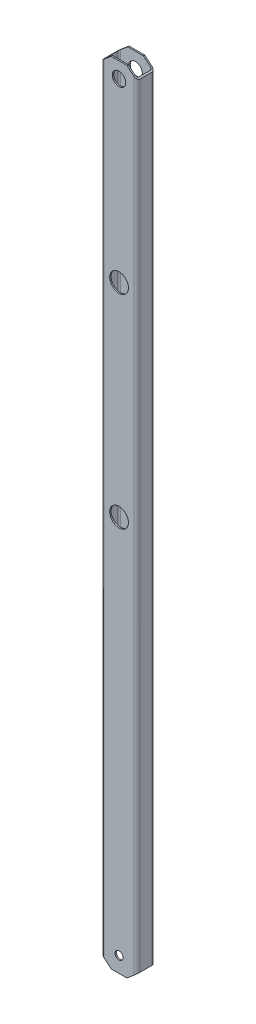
from build123d import *

# Parameters (mm, degrees)
TUBO_RETTANGOLARE_80_X_40_X_3_0_2_DEPTH = 1770
TAGLIO_ESTRUSIONE1_REACH                = 888.806
SCHIZZO8_R                              = 15
SCHIZZO8_R_2                            = 21
SCHIZZO8_R_3                            = 9
TAGLIO_ESTRUSIONE3_REACH                = 888.806
SCHIZZO9_R                              = 21


with BuildPart() as part:
    # Sketch15 → Tubo rettangolare 80 X 40 X 3.0_2 (new body)
    with BuildSketch(Plane(origin=(0, 885, 0), x_dir=(0, 0, -1), z_dir=(0, -1, 0))):
        with BuildLine():
            Line((-13.6, -40), (13.6, -40))
            ThreePointArc((13.6, -40), (18.1254834, -38.1254834), (20, -33.6))
            Line((20, -33.6), (20, 33.6))
            ThreePointArc((20, 33.6), (18.1254834, 38.1254834), (13.6, 40))
            Line((13.6, 40), (-13.6, 40))
            ThreePointArc((-13.6, 40), (-18.1254834, 38.1254834), (-20, 33.6))
            Line((-20, 33.6), (-20, -33.6))
            ThreePointArc((-20, -33.6), (-18.1254834, -38.1254834), (-13.6, -40))
        make_face()
        with BuildLine():
            Line((-13.6, -37), (13.6, -37))
            ThreePointArc((13.6, -37), (16.004163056, -36.004163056), (17, -33.6))
            Line((17, -33.6), (17, 33.6))
            ThreePointArc((17, 33.6), (16.004163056, 36.004163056), (13.6, 37))
            Line((13.6, 37), (-13.6, 37))
            ThreePointArc((-13.6, 37), (-16.004163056, 36.004163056), (-17, 33.6))
            Line((-17, 33.6), (-17, -33.6))
            ThreePointArc((-17, -33.6), (-16.004163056, -36.004163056), (-13.6, -37))
        make_face(mode=Mode.SUBTRACT)
    extrude(amount=TUBO_RETTANGOLARE_80_X_40_X_3_0_2_DEPTH)

    # Taglio-Estrusione1: up to this face of the body (flat: up to its plane)
    taglio_estrusione1_end = Plane(part.part.faces().sort_by_distance((0, 0, -20))[0])
    # Schizzo8 → Taglio-Estrusione1 (cut, up to the picked face)
    with BuildSketch(Plane.XY.offset(20), mode=Mode.PRIVATE) as taglio_estrusione1_sk1:
        with Locations(Location((0, 850, 0), (0, 0, 270))):
            Circle(SCHIZZO8_R)
    taglio_estrusione1_tool1 = split(extrude(taglio_estrusione1_sk1.sketch, amount=-TAGLIO_ESTRUSIONE1_REACH, mode=Mode.PRIVATE), bisect_by=taglio_estrusione1_end, keep=Keep.BOTH, mode=Mode.PRIVATE)
    # Schizzo8 → Taglio-Estrusione1 (cut, up to the picked face)
    with BuildSketch(Plane.XY.offset(20), mode=Mode.PRIVATE) as taglio_estrusione1_sk2:
        with Locations(Location((0, 0, 0), (0, 0, 270))):
            Circle(SCHIZZO8_R_2)
    taglio_estrusione1_tool2 = split(extrude(taglio_estrusione1_sk2.sketch, amount=-TAGLIO_ESTRUSIONE1_REACH, mode=Mode.PRIVATE), bisect_by=taglio_estrusione1_end, keep=Keep.BOTH, mode=Mode.PRIVATE)
    # Schizzo8 → Taglio-Estrusione1 (cut, up to the picked face)
    with BuildSketch(Plane.XY.offset(20), mode=Mode.PRIVATE) as taglio_estrusione1_sk3:
        with Locations(Location((0, -850, 0), (0, 0, 270))):
            Circle(SCHIZZO8_R_3)
    taglio_estrusione1_tool3 = split(extrude(taglio_estrusione1_sk3.sketch, amount=-TAGLIO_ESTRUSIONE1_REACH, mode=Mode.PRIVATE), bisect_by=taglio_estrusione1_end, keep=Keep.BOTH, mode=Mode.PRIVATE)
    # Schizzo8 → Taglio-Estrusione1 (cut, up to the picked face)
    with BuildSketch(Plane.XY.offset(20), mode=Mode.PRIVATE) as taglio_estrusione1_sk4:
        Polygon((-40, 866.120258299), (-17.5, 885), (-40, 885), align=None)
    taglio_estrusione1_tool4 = split(extrude(taglio_estrusione1_sk4.sketch, amount=-TAGLIO_ESTRUSIONE1_REACH, mode=Mode.PRIVATE), bisect_by=taglio_estrusione1_end, keep=Keep.BOTH, mode=Mode.PRIVATE)
    # Schizzo8 → Taglio-Estrusione1 (cut, up to the picked face)
    with BuildSketch(Plane.XY.offset(20), mode=Mode.PRIVATE) as taglio_estrusione1_sk5:
        Polygon((17.5, 885), (40, 885), (40, 866.120258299), align=None)
    taglio_estrusione1_tool5 = split(extrude(taglio_estrusione1_sk5.sketch, amount=-TAGLIO_ESTRUSIONE1_REACH, mode=Mode.PRIVATE), bisect_by=taglio_estrusione1_end, keep=Keep.BOTH, mode=Mode.PRIVATE)
    # Schizzo8 → Taglio-Estrusione1 (cut, up to the picked face)
    with BuildSketch(Plane.XY.offset(20), mode=Mode.PRIVATE) as taglio_estrusione1_sk6:
        Polygon((40, -866.120258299), (17.5, -885), (40, -885), align=None)
    taglio_estrusione1_tool6 = split(extrude(taglio_estrusione1_sk6.sketch, amount=-TAGLIO_ESTRUSIONE1_REACH, mode=Mode.PRIVATE), bisect_by=taglio_estrusione1_end, keep=Keep.BOTH, mode=Mode.PRIVATE)
    # Schizzo8 → Taglio-Estrusione1 (cut, up to the picked face)
    with BuildSketch(Plane.XY.offset(20), mode=Mode.PRIVATE) as taglio_estrusione1_sk7:
        Polygon((-17.5, -885), (-40, -885), (-40, -866.120258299), align=None)
    taglio_estrusione1_tool7 = split(extrude(taglio_estrusione1_sk7.sketch, amount=-TAGLIO_ESTRUSIONE1_REACH, mode=Mode.PRIVATE), bisect_by=taglio_estrusione1_end, keep=Keep.BOTH, mode=Mode.PRIVATE)
    add(taglio_estrusione1_tool1.solids().sort_by(Axis((0, 850, 20), (0, 0, -1)))[0], mode=Mode.SUBTRACT)
    add(taglio_estrusione1_tool2.solids().sort_by(Axis((0, 0, 20), (0, 0, -1)))[0], mode=Mode.SUBTRACT)
    add(taglio_estrusione1_tool3.solids().sort_by(Axis((0, -850, 20), (0, 0, -1)))[0], mode=Mode.SUBTRACT)
    add(taglio_estrusione1_tool4.solids().sort_by(Axis((-32.5, 878.706753, 20), (0, 0, -1)))[0], mode=Mode.SUBTRACT)
    add(taglio_estrusione1_tool5.solids().sort_by(Axis((32.5, 878.706753, 20), (0, 0, -1)))[0], mode=Mode.SUBTRACT)
    add(taglio_estrusione1_tool6.solids().sort_by(Axis((32.5, -878.706753, 20), (0, 0, -1)))[0], mode=Mode.SUBTRACT)
    add(taglio_estrusione1_tool7.solids().sort_by(Axis((-32.5, -878.706753, 20), (0, 0, -1)))[0], mode=Mode.SUBTRACT)

    # Taglio-Estrusione3: up to this face of the body (flat: up to its plane)
    taglio_estrusione3_end = Plane(part.part.faces().sort_by_distance((-14.16446247, 864.676492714, -20))[0])
    # Schizzo9 → Taglio-Estrusione3 (cut, up to the picked face)
    with BuildSketch(Plane.XY.offset(20), mode=Mode.PRIVATE) as taglio_estrusione3_sk1:
        with Locations(Location((0, 455, 0), (0, 0, 270))):
            Circle(SCHIZZO9_R)
    taglio_estrusione3_tool1 = split(extrude(taglio_estrusione3_sk1.sketch, amount=-TAGLIO_ESTRUSIONE3_REACH, mode=Mode.PRIVATE), bisect_by=taglio_estrusione3_end, keep=Keep.BOTH, mode=Mode.PRIVATE)
    add(taglio_estrusione3_tool1.solids().sort_by(Axis((0, 455, 20), (0, 0, -1)))[0], mode=Mode.SUBTRACT)


solid = part.part
